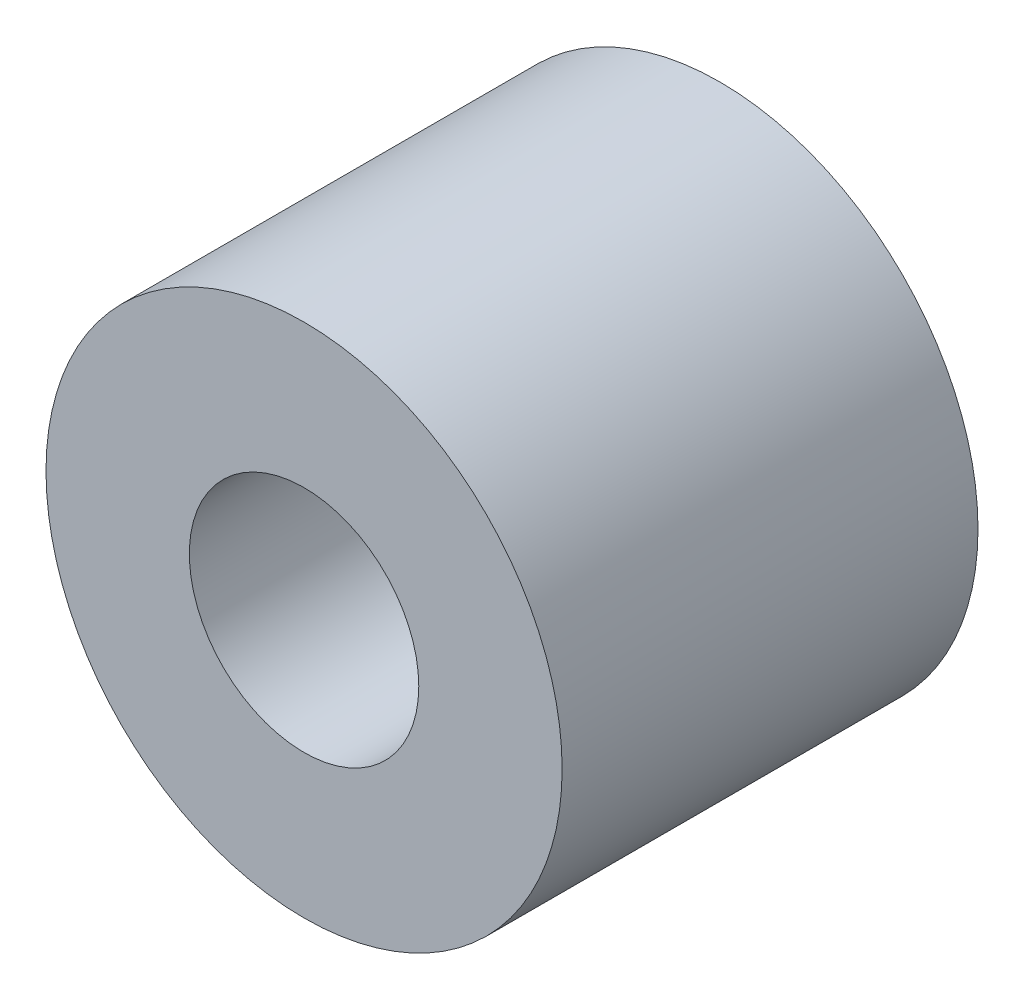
from build123d import *

# Parameters (mm, degrees)
ESQUISSE1_R      = 8.997821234
ESQUISSE1_R_2    = 4
EXTRUSION1_DEPTH = 14.5


with BuildPart() as part:
    # Esquisse1 → Extrusion1 (new body)
    with BuildSketch(Plane.XY):
        Circle(ESQUISSE1_R)
        Circle(ESQUISSE1_R_2, mode=Mode.SUBTRACT)
    extrude(amount=EXTRUSION1_DEPTH)


solid = part.part
